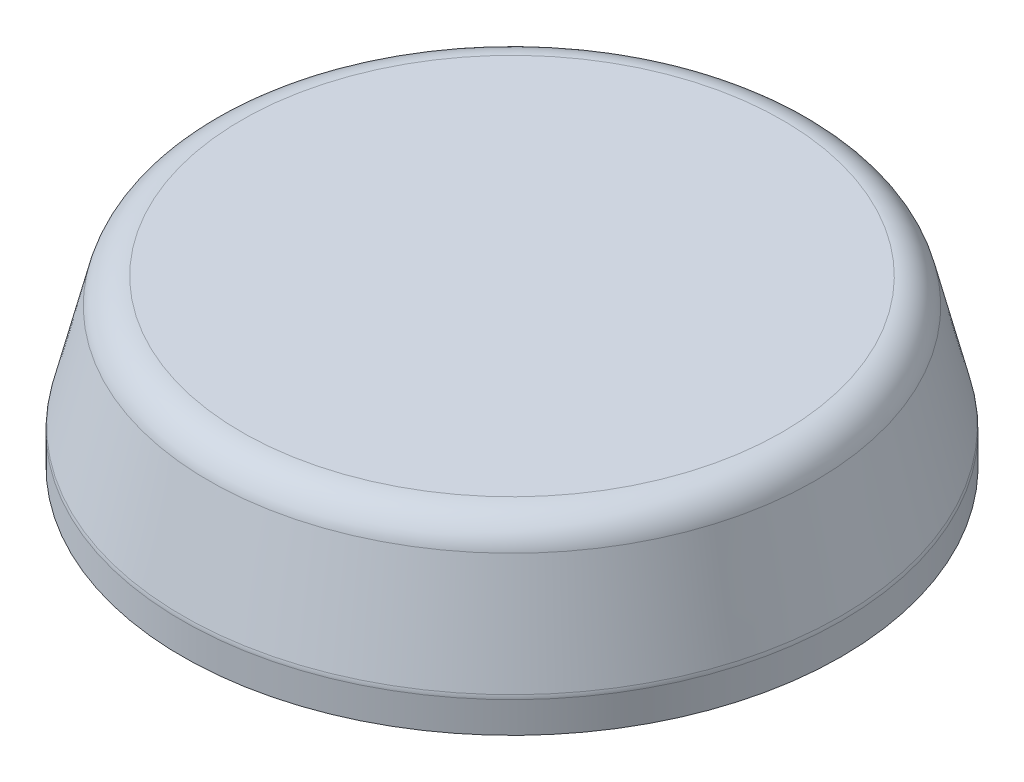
from build123d import *


with BuildPart() as part:
    # Sketch1 → Revolve1 (revolve)
    with BuildSketch(Plane.XY, mode=Mode.PRIVATE) as revolve1_sk:
        with BuildLine():
            Line((-121.92, 0), (-127, 0))
            Line((-127, 0), (-127, 11.923117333))
            ThreePointArc((-127, 11.923117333), (-126.953003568, 12.694250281), (-126.812709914, 13.4539689))
            Line((-126.812709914, 13.4539689), (-116.84, 53.600851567))
            ThreePointArc((-116.84, 53.600851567), (-112.21597948, 60.73138426), (-104.181004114, 63.5))
            Line((-104.181004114, 63.5), (0, 63.5))
            Line((0, 63.5), (0, 58.42))
            Line((0, 58.42), (-105.597290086, 58.42))
            ThreePointArc((-105.597290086, 58.42), (-109.508913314, 57.072169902), (-111.76, 53.600851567))
            Line((-111.76, 53.600851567), (-121.732709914, 13.4539689))
            ThreePointArc((-121.732709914, 13.4539689), (-121.873003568, 12.694250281), (-121.92, 11.923117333))
            Line((-121.92, 11.923117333), (-121.92, 0))
        make_face()
    revolve(revolve1_sk.sketch.rotate(Axis((0, 0, 0), (0, 1, 0)), 180), axis=Axis((0, 0, 0), (0, 1, 0)))


solid = part.part
